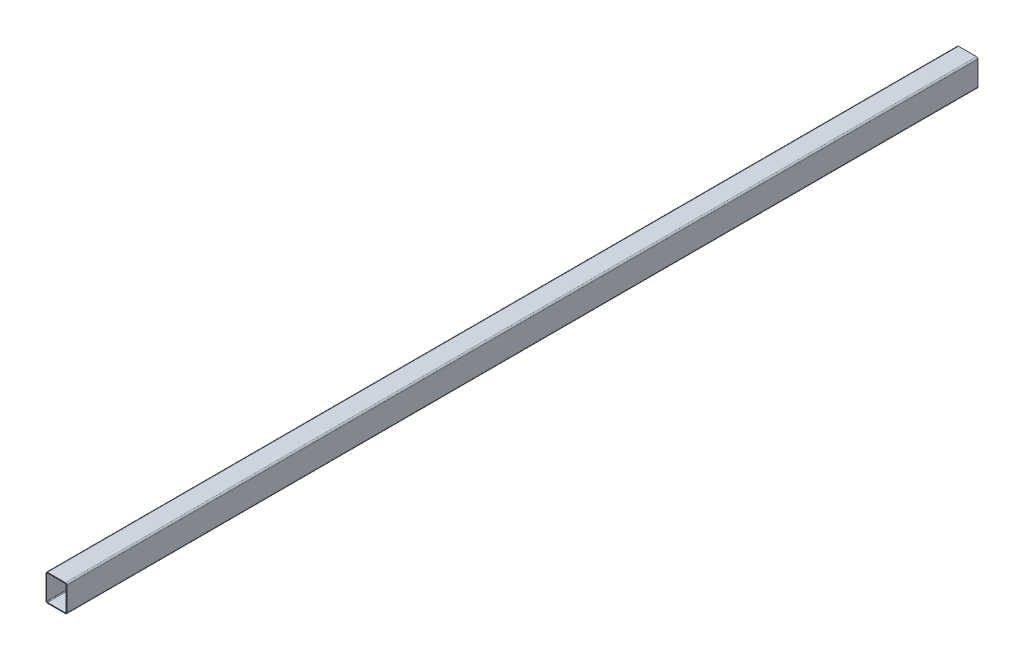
from build123d import *

# Parameters (mm, degrees)
BOSS_EXTRUDE1_DEPTH = 304.8


with BuildPart() as part:
    # Sketch1 → Boss-Extrude1 (new body)
    with BuildSketch(Plane.XY):
        with BuildLine():
            Line((0.586806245, 9.076504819), (6.586806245, 9.076504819))
            ThreePointArc((6.586806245, 9.076504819), (6.940359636, 8.930058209), (7.086806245, 8.576504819))
            Line((7.086806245, 8.576504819), (7.086806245, 0.576504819))
            ThreePointArc((7.086806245, 0.576504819), (6.940359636, 0.222951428), (6.586806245, 0.076504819))
            Line((6.586806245, 0.076504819), (0.586806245, 0.076504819))
            ThreePointArc((0.586806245, 0.076504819), (0.233252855, 0.222951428), (0.086806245, 0.576504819))
            Line((0.086806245, 0.576504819), (0.086806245, 8.576504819))
            ThreePointArc((0.086806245, 8.576504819), (0.233252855, 8.930058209), (0.586806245, 9.076504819))
        make_face()
        with BuildLine():
            Line((0.586806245, 8.826504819), (6.586806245, 8.826504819))
            ThreePointArc((6.586806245, 8.826504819), (6.76358294, 8.753281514), (6.836806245, 8.576504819))
            Line((6.836806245, 8.576504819), (6.836806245, 0.576504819))
            ThreePointArc((6.836806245, 0.576504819), (6.76358294, 0.399728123), (6.586806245, 0.326504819))
            Line((6.586806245, 0.326504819), (0.586806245, 0.326504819))
            ThreePointArc((0.586806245, 0.326504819), (0.41002955, 0.399728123), (0.336806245, 0.576504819))
            Line((0.336806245, 0.576504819), (0.336806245, 8.576504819))
            ThreePointArc((0.336806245, 8.576504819), (0.41002955, 8.753281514), (0.586806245, 8.826504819))
        make_face(mode=Mode.SUBTRACT)
    extrude(amount=BOSS_EXTRUDE1_DEPTH)


solid = part.part
